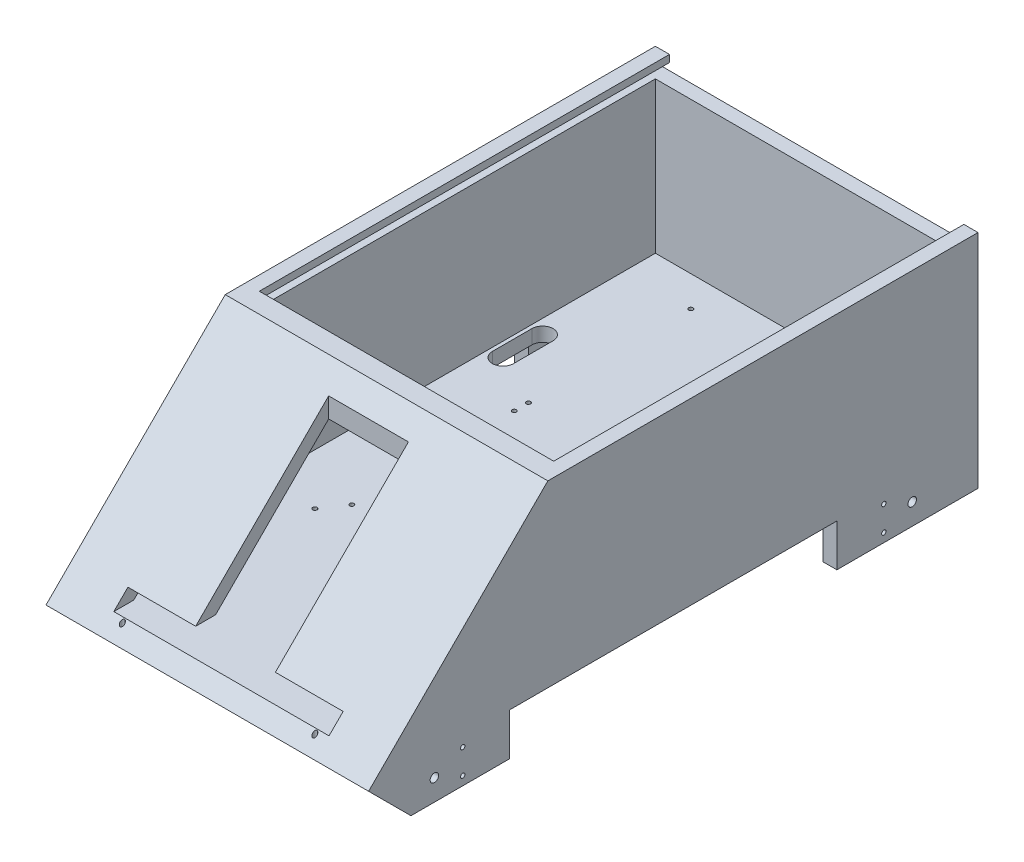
from build123d import *

# Parameters (mm, degrees)
BOSS_EXTRUDE2_DEPTH               = 114.3
SHELL2_T                          = -10
CUT_EXTRUDE2_DEPTH                = 299.8
SKETCH5_W                         = 208.6
SKETCH5_H                         = 5
CUT_EXTRUDE3_DEPTH                = 10
BASE_HOLE_W                       = 152.5
BASE_HOLE_H                       = 152
CUT_EXTRUDE5_DEPTH                = 10
SKETCH16_W                        = 56.5
SKETCH16_H                        = 56.5
CUT_EXTRUDE7_DEPTH                = 120
SKETCH17_W                        = 56.5
SKETCH17_H                        = 47.75
CUT_EXTRUDE8_DEPTH                = 120
SIDEWALL_MOTOR_TABS1_W            = 100
SIDEWALL_MOTOR_TABS1_H            = 30
MOTOR_MOUNT_WALL1_DEPTH           = 10
SIDEWALL_MOTOR_TABS2_W            = 100
SIDEWALL_MOTOR_TABS2_H            = 30
MOTOR_MOUNT_WALL2_DEPTH           = 10
CUT_EXTRUDE_REAR_SLOTS_DEPTH      = 10
CUT_EXTRUDE_FRONT_SLOTS_DEPTH     = 10
SKETCH25_R                        = 3
SKETCH25_R_2                      = 1.55
MOTOR_HOLES_DEPTH                 = 505.815015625
REFERENCE1_BASE_R                 = 1.55
CUT_EXTRUDE9_DEPTH                = 10
SKETCH26_R                        = 1.5
CUT_EXTRUDE_TOWERBASE_HOLES_DEPTH = 10


with BuildPart() as part:
    # Sketch3 → Boss-Extrude2 (new, symmetric)
    with BuildSketch(Plane(origin=(0, 0, 0), x_dir=(0, 0, -1), z_dir=(1, 0, 0))):
        Polygon((0, 0), (431.8, 0), (431.8, 127), (127, 127), align=None)
    extrude(amount=BOSS_EXTRUDE2_DEPTH, both=True)

    # Shell2
    shell2_openings = [part.faces().sort_by_distance(p)[0] for p in [
        (0, 127, -279.4),
    ]]
    offset(amount=SHELL2_T, openings=shell2_openings, kind=Kind.INTERSECTION)

    # Sketch4 → Cut-Extrude2 (cut)
    with BuildSketch(Plane(origin=(0, 0, -431.8), x_dir=(-1, 0, 0), z_dir=(0, 0, -1))):
        Polygon((-104.3, 122), (-109.3, 122), (-109.3, 117), (-104.3, 117), (104.3, 117), (109.3, 117), (109.3, 122), (104.3, 122), align=None)
    extrude(amount=-CUT_EXTRUDE2_DEPTH, mode=Mode.SUBTRACT)

    # Sketch5 → Cut-Extrude3 (cut)
    with BuildSketch(Plane(origin=(0, 0, -431.8), x_dir=(-1, 0, 0), z_dir=(0, 0, -1))):
        with Locations((0, 124.5)):
            Rectangle(SKETCH5_W, SKETCH5_H)
    extrude(amount=-CUT_EXTRUDE3_DEPTH, mode=Mode.SUBTRACT)

    # Base hole → Cut-Extrude5 (cut)
    with BuildSketch(Plane(origin=(0, 10, 0), x_dir=(1, 0, 0), z_dir=(0, 1, 0))):
        with Locations((0, 86)):
            Rectangle(BASE_HOLE_W, BASE_HOLE_H)
    extrude(amount=CUT_EXTRUDE5_DEPTH, mode=Mode.SUBTRACT)

    # Sketch16 → Cut-Extrude7 (cut)
    with BuildSketch(Plane(origin=(0, 10, 0), x_dir=(1, 0, 0), z_dir=(0, 1, 0))):
        with Locations((0, 86)):
            Rectangle(SKETCH16_W, SKETCH16_H)
    extrude(amount=CUT_EXTRUDE7_DEPTH, mode=Mode.SUBTRACT)

    # Sketch17 → Cut-Extrude8 (cut)
    with BuildSketch(Plane(origin=(0, 10, 0), x_dir=(1, 0, 0), z_dir=(0, 1, 0))):
        with Locations((0, 33.875)):
            Rectangle(SKETCH17_W, SKETCH17_H)
    extrude(amount=CUT_EXTRUDE8_DEPTH, mode=Mode.SUBTRACT)

    # Sidewall_Motor_Tabs1 → Motor_Mount_Wall1 (add)
    with BuildSketch(Plane(origin=(114.3, 0, 0), x_dir=(0, 0, -1), z_dir=(1, 0, 0))):
        Polygon((0, 0), (30, -30), (100, -30), (100, 0), align=None)
        with Locations((381.8, -15)):
            Rectangle(SIDEWALL_MOTOR_TABS1_W, SIDEWALL_MOTOR_TABS1_H)
    extrude(amount=-MOTOR_MOUNT_WALL1_DEPTH)

    # Sidewall_Motor_Tabs2 → Motor_Mount_Wall2 (add)
    with BuildSketch(Plane.ZY.offset(114.3)):
        Polygon((0, 0), (-30, -30), (-100, -30), (-100, 0), align=None)
        with Locations((-381.8, -15)):
            Rectangle(SIDEWALL_MOTOR_TABS2_W, SIDEWALL_MOTOR_TABS2_H)
    extrude(amount=-MOTOR_MOUNT_WALL2_DEPTH)

    # Rear Slots → Cut-Extrude_Rear Slots (cut)
    with BuildSketch(Plane(origin=(0, 10, 0), x_dir=(1, 0, 0), z_dir=(0, 1, 0))):
        with BuildLine():
            Line((-86.8, 331.8), (-86.8, 303.8))
            ThreePointArc((-86.8, 303.8), (-94.3, 296.3), (-101.8, 303.8))
            Line((-101.8, 303.8), (-101.8, 331.8))
            ThreePointArc((-101.8, 331.8), (-94.3, 339.3), (-86.8, 331.8))
        make_face()
        with BuildLine():
            Line((86.8, 331.8), (86.8, 303.8))
            ThreePointArc((86.8, 303.8), (94.3, 296.3), (101.8, 303.8))
            Line((101.8, 303.8), (101.8, 331.8))
            ThreePointArc((101.8, 331.8), (94.3, 339.3), (86.8, 331.8))
        make_face()
    extrude(amount=-CUT_EXTRUDE_REAR_SLOTS_DEPTH, mode=Mode.SUBTRACT)

    # Front Slots → Cut-Extrude_Front Slots (cut)
    with BuildSketch(Plane(origin=(0, 10, 0), x_dir=(1, 0, 0), z_dir=(0, 1, 0))):
        with BuildLine():
            Line((-86.8, 128), (-86.8, 100))
            ThreePointArc((-86.8, 100), (-94.3, 92.5), (-101.8, 100))
            Line((-101.8, 100), (-101.8, 128))
            ThreePointArc((-101.8, 128), (-94.3, 135.5), (-86.8, 128))
        make_face()
        with BuildLine():
            Line((86.8, 128), (86.8, 100))
            ThreePointArc((86.8, 100), (94.3, 92.5), (101.8, 100))
            Line((101.8, 100), (101.8, 128))
            ThreePointArc((101.8, 128), (94.3, 135.5), (86.8, 128))
        make_face()
    extrude(amount=-CUT_EXTRUDE_FRONT_SLOTS_DEPTH, mode=Mode.SUBTRACT)

    # Sketch25 → Motor_Holes (cut, through all)
    with BuildSketch(Plane.ZY.offset(114.3)):
        with Locations((-385.2, -15)):
            Circle(SKETCH25_R)
        with Locations((-365.1, -6.25)):
            Circle(SKETCH25_R_2)
        with Locations((-365.1, -23.75)):
            Circle(SKETCH25_R_2)
        with Locations((-66.7, -23.75)):
            Circle(SKETCH25_R_2)
        with Locations((-66.7, -6.25)):
            Circle(SKETCH25_R_2)
        with Locations((-46.6, -15)):
            Circle(SKETCH25_R)
    extrude(amount=-MOTOR_HOLES_DEPTH, mode=Mode.SUBTRACT)

    # Reference1 Base → Cut-Extrude9 (cut)
    with BuildSketch(Plane.XZ):
        with Locations(Location((-68.2, -144.4, 0), (0, 0, 270))):
            Circle(REFERENCE1_BASE_R)
        with Locations(Location((-68.2, -8, 0), (0, 0, 270))):
            Circle(REFERENCE1_BASE_R)
        with Locations(Location((68.2, -144.4, 0), (0, 0, 90))):
            Circle(REFERENCE1_BASE_R)
        with Locations(Location((68.2, -8, 0), (0, 0, 90))):
            Circle(REFERENCE1_BASE_R)
    extrude(amount=-CUT_EXTRUDE9_DEPTH, mode=Mode.SUBTRACT)

    # Sketch26 → Cut-Extrude_TowerBase_Holes (cut)
    with BuildSketch(Plane.XZ):
        with Locations(Location((-57.54, -159.94, 0), (0, 0, 270))):
            Circle(SKETCH26_R)
        with Locations(Location((57.54, -159.94, 0), (0, 0, 90))):
            Circle(SKETCH26_R)
        with Locations(Location((-57.54, -275.02, 0), (0, 0, 270))):
            Circle(SKETCH26_R)
        with Locations(Location((57.54, -275.02, 0), (0, 0, 90))):
            Circle(SKETCH26_R)
        with Locations(Location((-57.54, -285.1, 0), (0, 0, 270))):
            Circle(SKETCH26_R)
        with Locations(Location((-57.54, -400.18, 0), (0, 0, 270))):
            Circle(SKETCH26_R)
        with Locations(Location((57.54, -285.1, 0), (0, 0, 90))):
            Circle(SKETCH26_R)
        with Locations(Location((57.54, -400.18, 0), (0, 0, 90))):
            Circle(SKETCH26_R)
    extrude(amount=-CUT_EXTRUDE_TOWERBASE_HOLES_DEPTH, mode=Mode.SUBTRACT)


solid = part.part
